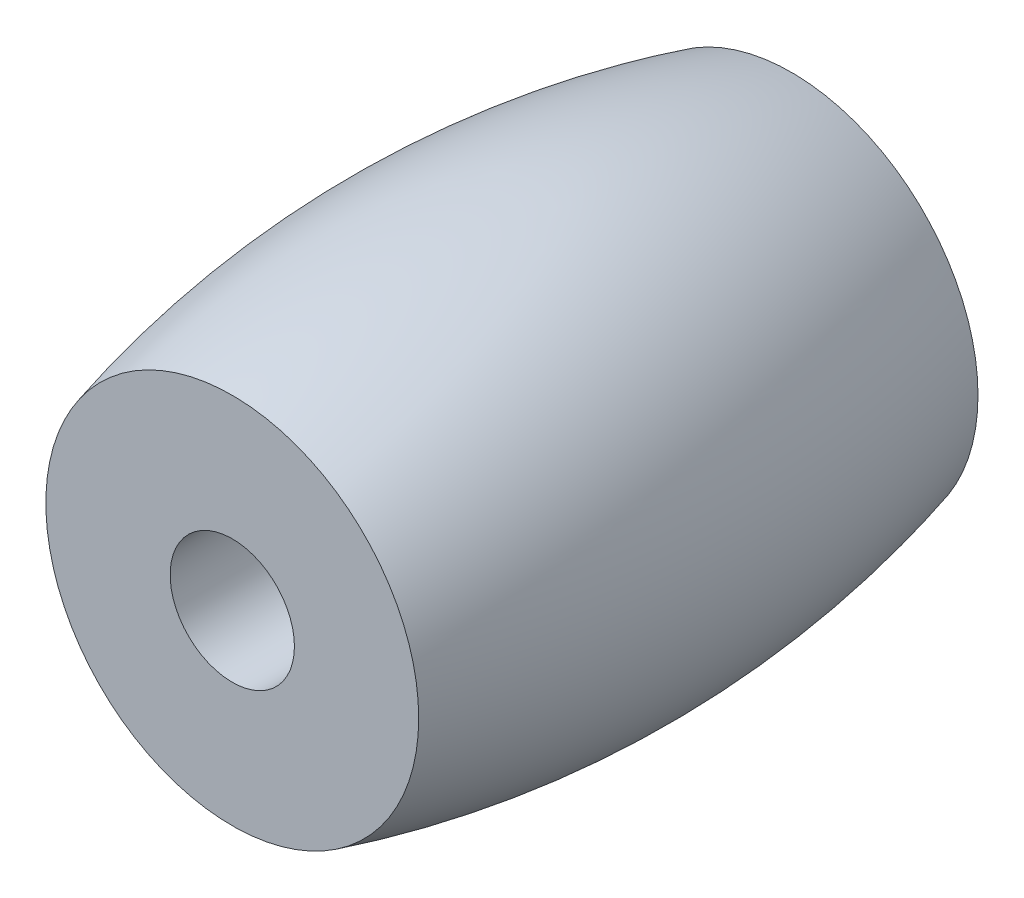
from build123d import *


with BuildPart() as part:
    # Sketch 1 → Revolve 1 (revolve)
    with BuildSketch(Plane(origin=(0, 0, 0), x_dir=(1, 0, 0), z_dir=(0, 1, 0))):
        with BuildLine():
            Line((4.5, 6.75), (1.5, 6.75))
            Line((1.5, 6.75), (1.5, -6.75))
            Line((1.5, -6.75), (4.5, -6.75))
            ThreePointArc((4.5, -6.75), (5.4, 0), (4.5, 6.75))
        make_face()
    revolve(axis=Axis((0, 0, -6.75), (0, 0, 1)))


solid = part.part
